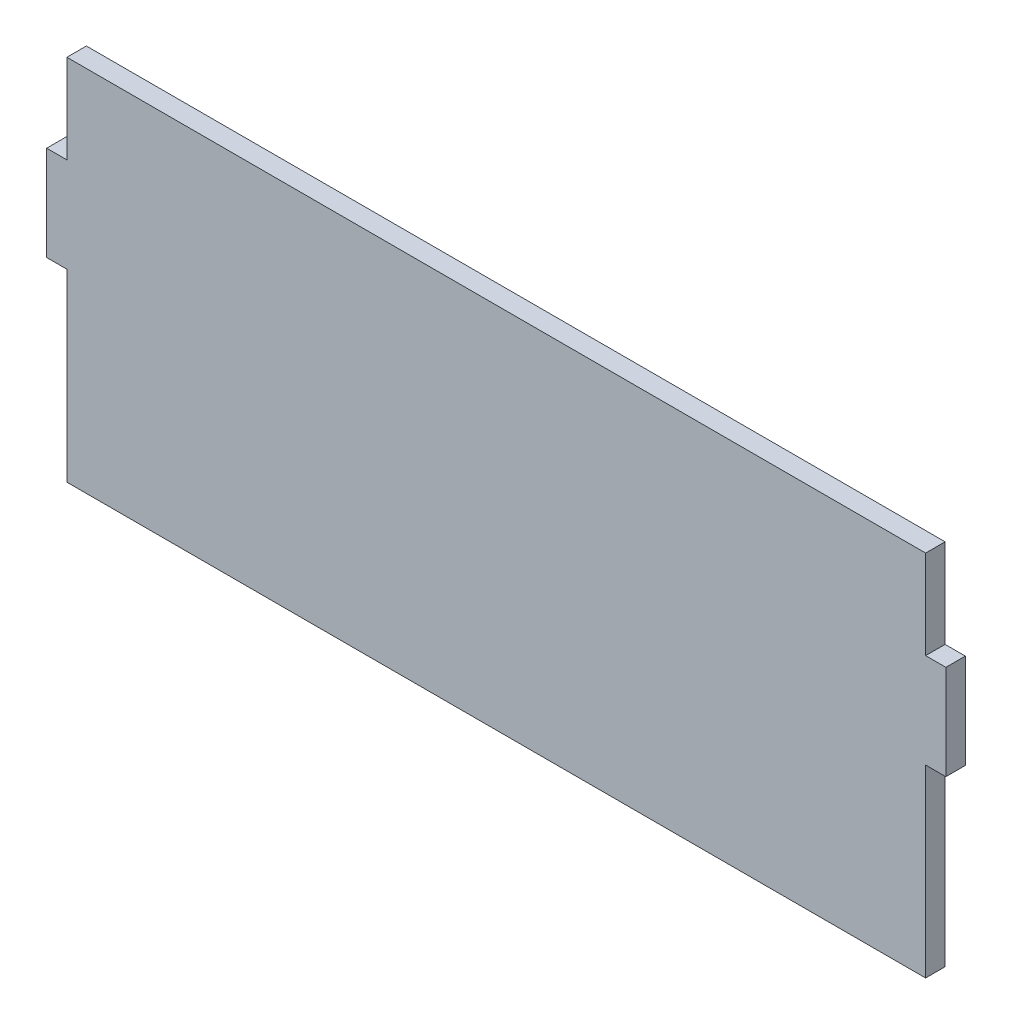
ISO-10303-21;
HEADER;
FILE_DESCRIPTION(('STEP AP214'),'2;1');
FILE_NAME('part.step','',(''),(''),'','','');
FILE_SCHEMA(('AUTOMOTIVE_DESIGN { 1 0 10303 214 1 1 1 1 }'));
ENDSEC;
DATA;
#1=APPLICATION_CONTEXT('core data for automotive mechanical design processes');
#2=APPLICATION_PROTOCOL_DEFINITION('international standard','automotive_design',2000,#1);
#3=PRODUCT_CONTEXT('',#1,'mechanical');
#4=PRODUCT('Part','Part','',(#3));
#5=PRODUCT_RELATED_PRODUCT_CATEGORY('part','',(#4));
#6=PRODUCT_DEFINITION_FORMATION('','',#4);
#7=PRODUCT_DEFINITION_CONTEXT('part definition',#1,'design');
#8=PRODUCT_DEFINITION('design','',#6,#7);
#9=PRODUCT_DEFINITION_SHAPE('','',#8);
#10=(LENGTH_UNIT() NAMED_UNIT(*) SI_UNIT(.MILLI.,.METRE.));
#11=(NAMED_UNIT(*) PLANE_ANGLE_UNIT() SI_UNIT($,.RADIAN.));
#12=(NAMED_UNIT(*) SI_UNIT($,.STERADIAN.) SOLID_ANGLE_UNIT());
#13=UNCERTAINTY_MEASURE_WITH_UNIT(LENGTH_MEASURE(1.E-05),#10,'distance_accuracy_value','');
#14=(GEOMETRIC_REPRESENTATION_CONTEXT(3) GLOBAL_UNCERTAINTY_ASSIGNED_CONTEXT((#13)) GLOBAL_UNIT_ASSIGNED_CONTEXT((#10,
#11,#12)) REPRESENTATION_CONTEXT('',''));
#15=CARTESIAN_POINT('',(0.,0.,0.));
#16=DIRECTION('',(0.,0.,1.));
#17=DIRECTION('',(1.,0.,0.));
#18=AXIS2_PLACEMENT_3D('',#15,#16,#17);
#19=CARTESIAN_POINT('',(-70.0367249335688,20.7668110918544,2.6));
#20=DIRECTION('',(0.,-1.,0.));
#21=DIRECTION('',(1.,0.,0.));
#22=AXIS2_PLACEMENT_3D('',#19,#20,#21);
#23=PLANE('',#22);
#24=DIRECTION('',(-1.,0.,0.));
#25=VECTOR('',#24,1.);
#26=CARTESIAN_POINT('',(-70.0367249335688,20.7668110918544,0.));
#27=LINE('',#26,#25);
#28=CARTESIAN_POINT('',(44.5632750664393,20.7668110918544,0.));
#29=VERTEX_POINT('',#28);
#30=CARTESIAN_POINT('',(-70.0367249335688,20.7668110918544,0.));
#31=VERTEX_POINT('',#30);
#32=EDGE_CURVE('E102',#29,#31,#27,.T.);
#33=ORIENTED_EDGE('',*,*,#32,.T.);
#34=DIRECTION('',(0.,0.,-1.));
#35=VECTOR('',#34,1.);
#36=CARTESIAN_POINT('',(-70.0367249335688,20.7668110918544,2.6));
#37=LINE('',#36,#35);
#38=CARTESIAN_POINT('',(-70.0367249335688,20.7668110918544,2.6));
#39=VERTEX_POINT('',#38);
#40=EDGE_CURVE('E11',#39,#31,#37,.T.);
#41=ORIENTED_EDGE('',*,*,#40,.F.);
#42=DIRECTION('',(-1.,0.,0.));
#43=VECTOR('',#42,1.);
#44=CARTESIAN_POINT('',(44.5632750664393,20.7668110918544,2.6));
#45=LINE('',#44,#43);
#46=CARTESIAN_POINT('',(44.5632750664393,20.7668110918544,2.6));
#47=VERTEX_POINT('',#46);
#48=EDGE_CURVE('E108',#47,#39,#45,.T.);
#49=ORIENTED_EDGE('',*,*,#48,.F.);
#50=DIRECTION('',(0.,0.,-1.));
#51=VECTOR('',#50,1.);
#52=CARTESIAN_POINT('',(44.5632750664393,20.7668110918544,2.6));
#53=LINE('',#52,#51);
#54=EDGE_CURVE('E153',#47,#29,#53,.T.);
#55=ORIENTED_EDGE('',*,*,#54,.T.);
#56=EDGE_LOOP('',(#33,#41,#49,#55));
#57=FACE_BOUND('',#56,.T.);
#58=ADVANCED_FACE('F38',(#57),#23,.F.);
#59=CARTESIAN_POINT('',(-70.0367249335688,8.9074360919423,2.6));
#60=DIRECTION('',(1.,0.,0.));
#61=DIRECTION('',(0.,0.,-1.));
#62=AXIS2_PLACEMENT_3D('',#59,#60,#61);
#63=PLANE('',#62);
#64=DIRECTION('',(0.,-1.,0.));
#65=VECTOR('',#64,1.);
#66=CARTESIAN_POINT('',(-70.0367249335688,8.9074360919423,0.));
#67=LINE('',#66,#65);
#68=CARTESIAN_POINT('',(-70.0367249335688,8.9074360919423,0.));
#69=VERTEX_POINT('',#68);
#70=EDGE_CURVE('E158',#31,#69,#67,.T.);
#71=ORIENTED_EDGE('',*,*,#70,.T.);
#72=DIRECTION('',(0.,0.,-1.));
#73=VECTOR('',#72,1.);
#74=CARTESIAN_POINT('',(-70.0367249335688,8.9074360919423,2.6));
#75=LINE('',#74,#73);
#76=CARTESIAN_POINT('',(-70.0367249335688,8.9074360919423,2.6));
#77=VERTEX_POINT('',#76);
#78=EDGE_CURVE('E46',#77,#69,#75,.T.);
#79=ORIENTED_EDGE('',*,*,#78,.F.);
#80=DIRECTION('',(0.,-1.,0.));
#81=VECTOR('',#80,1.);
#82=CARTESIAN_POINT('',(-70.0367249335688,8.9074360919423,2.6));
#83=LINE('',#82,#81);
#84=EDGE_CURVE('E248',#39,#77,#83,.T.);
#85=ORIENTED_EDGE('',*,*,#84,.F.);
#86=ORIENTED_EDGE('',*,*,#40,.T.);
#87=EDGE_LOOP('',(#71,#79,#85,#86));
#88=FACE_BOUND('',#87,.T.);
#89=ADVANCED_FACE('F251',(#88),#63,.F.);
#90=CARTESIAN_POINT('',(-72.7367249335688,8.9074360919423,2.6));
#91=DIRECTION('',(0.,-1.,0.));
#92=DIRECTION('',(1.,0.,0.));
#93=AXIS2_PLACEMENT_3D('',#90,#91,#92);
#94=PLANE('',#93);
#95=DIRECTION('',(-1.,0.,0.));
#96=VECTOR('',#95,1.);
#97=CARTESIAN_POINT('',(-72.7367249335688,8.9074360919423,0.));
#98=LINE('',#97,#96);
#99=CARTESIAN_POINT('',(-72.7367249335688,8.9074360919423,0.));
#100=VERTEX_POINT('',#99);
#101=EDGE_CURVE('E160',#69,#100,#98,.T.);
#102=ORIENTED_EDGE('',*,*,#101,.T.);
#103=DIRECTION('',(0.,0.,-1.));
#104=VECTOR('',#103,1.);
#105=CARTESIAN_POINT('',(-72.7367249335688,8.9074360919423,2.6));
#106=LINE('',#105,#104);
#107=CARTESIAN_POINT('',(-72.7367249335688,8.9074360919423,2.6));
#108=VERTEX_POINT('',#107);
#109=EDGE_CURVE('E199',#108,#100,#106,.T.);
#110=ORIENTED_EDGE('',*,*,#109,.F.);
#111=DIRECTION('',(-1.,0.,0.));
#112=VECTOR('',#111,1.);
#113=CARTESIAN_POINT('',(-72.7367249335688,8.9074360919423,2.6));
#114=LINE('',#113,#112);
#115=EDGE_CURVE('E208',#77,#108,#114,.T.);
#116=ORIENTED_EDGE('',*,*,#115,.F.);
#117=ORIENTED_EDGE('',*,*,#78,.T.);
#118=EDGE_LOOP('',(#102,#110,#116,#117));
#119=FACE_BOUND('',#118,.T.);
#120=ADVANCED_FACE('F206',(#119),#94,.F.);
#121=CARTESIAN_POINT('',(-72.7367249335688,-3.73314796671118,2.6));
#122=DIRECTION('',(1.,0.,0.));
#123=DIRECTION('',(0.,1.,0.));
#124=AXIS2_PLACEMENT_3D('',#121,#122,#123);
#125=PLANE('',#124);
#126=DIRECTION('',(0.,-1.,0.));
#127=VECTOR('',#126,1.);
#128=CARTESIAN_POINT('',(-72.7367249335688,-3.73314796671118,0.));
#129=LINE('',#128,#127);
#130=CARTESIAN_POINT('',(-72.7367249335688,-3.73314796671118,0.));
#131=VERTEX_POINT('',#130);
#132=EDGE_CURVE('E163',#100,#131,#129,.T.);
#133=ORIENTED_EDGE('',*,*,#132,.T.);
#134=DIRECTION('',(0.,0.,-1.));
#135=VECTOR('',#134,1.);
#136=CARTESIAN_POINT('',(-72.7367249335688,-3.73314796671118,2.6));
#137=LINE('',#136,#135);
#138=CARTESIAN_POINT('',(-72.7367249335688,-3.73314796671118,2.6));
#139=VERTEX_POINT('',#138);
#140=EDGE_CURVE('E196',#139,#131,#137,.T.);
#141=ORIENTED_EDGE('',*,*,#140,.F.);
#142=DIRECTION('',(0.,-1.,0.));
#143=VECTOR('',#142,1.);
#144=CARTESIAN_POINT('',(-72.7367249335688,8.9074360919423,2.6));
#145=LINE('',#144,#143);
#146=EDGE_CURVE('E225',#108,#139,#145,.T.);
#147=ORIENTED_EDGE('',*,*,#146,.F.);
#148=ORIENTED_EDGE('',*,*,#109,.T.);
#149=EDGE_LOOP('',(#133,#141,#147,#148));
#150=FACE_BOUND('',#149,.T.);
#151=ADVANCED_FACE('F216',(#150),#125,.F.);
#152=CARTESIAN_POINT('',(-72.7367249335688,-3.73314796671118,2.6));
#153=DIRECTION('',(0.,1.,0.));
#154=DIRECTION('',(0.,0.,1.));
#155=AXIS2_PLACEMENT_3D('',#152,#153,#154);
#156=PLANE('',#155);
#157=DIRECTION('',(1.,0.,0.));
#158=VECTOR('',#157,1.);
#159=CARTESIAN_POINT('',(-72.7367249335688,-3.73314796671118,0.));
#160=LINE('',#159,#158);
#161=CARTESIAN_POINT('',(-70.036724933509,-3.73314796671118,0.));
#162=VERTEX_POINT('',#161);
#163=EDGE_CURVE('E165',#131,#162,#160,.T.);
#164=ORIENTED_EDGE('',*,*,#163,.T.);
#165=DIRECTION('',(0.,0.,-1.));
#166=VECTOR('',#165,1.);
#167=CARTESIAN_POINT('',(-70.036724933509,-3.73314796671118,2.6));
#168=LINE('',#167,#166);
#169=CARTESIAN_POINT('',(-70.036724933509,-3.73314796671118,2.6));
#170=VERTEX_POINT('',#169);
#171=EDGE_CURVE('E193',#170,#162,#168,.T.);
#172=ORIENTED_EDGE('',*,*,#171,.F.);
#173=DIRECTION('',(1.,0.,0.));
#174=VECTOR('',#173,1.);
#175=CARTESIAN_POINT('',(-72.7367249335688,-3.73314796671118,2.6));
#176=LINE('',#175,#174);
#177=EDGE_CURVE('E222',#139,#170,#176,.T.);
#178=ORIENTED_EDGE('',*,*,#177,.F.);
#179=ORIENTED_EDGE('',*,*,#140,.T.);
#180=EDGE_LOOP('',(#164,#172,#178,#179));
#181=FACE_BOUND('',#180,.T.);
#182=ADVANCED_FACE('F220',(#181),#156,.F.);
#183=CARTESIAN_POINT('',(-70.036724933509,-3.73314796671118,2.6));
#184=DIRECTION('',(1.,0.,0.));
#185=DIRECTION('',(0.,0.,-1.));
#186=AXIS2_PLACEMENT_3D('',#183,#184,#185);
#187=PLANE('',#186);
#188=DIRECTION('',(0.,-1.,0.));
#189=VECTOR('',#188,1.);
#190=CARTESIAN_POINT('',(-70.036724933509,-3.73314796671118,0.));
#191=LINE('',#190,#189);
#192=CARTESIAN_POINT('',(-70.036724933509,-28.3482029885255,0.));
#193=VERTEX_POINT('',#192);
#194=EDGE_CURVE('E167',#162,#193,#191,.T.);
#195=ORIENTED_EDGE('',*,*,#194,.T.);
#196=DIRECTION('',(0.,0.,-1.));
#197=VECTOR('',#196,1.);
#198=CARTESIAN_POINT('',(-70.036724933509,-28.3482029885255,2.6));
#199=LINE('',#198,#197);
#200=CARTESIAN_POINT('',(-70.036724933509,-28.3482029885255,2.6));
#201=VERTEX_POINT('',#200);
#202=EDGE_CURVE('E190',#201,#193,#199,.T.);
#203=ORIENTED_EDGE('',*,*,#202,.F.);
#204=DIRECTION('',(0.,-1.,0.));
#205=VECTOR('',#204,1.);
#206=CARTESIAN_POINT('',(-70.036724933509,-3.73314796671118,2.6));
#207=LINE('',#206,#205);
#208=EDGE_CURVE('E224',#170,#201,#207,.T.);
#209=ORIENTED_EDGE('',*,*,#208,.F.);
#210=ORIENTED_EDGE('',*,*,#171,.T.);
#211=EDGE_LOOP('',(#195,#203,#209,#210));
#212=FACE_BOUND('',#211,.T.);
#213=ADVANCED_FACE('F263',(#212),#187,.F.);
#214=CARTESIAN_POINT('',(-70.036724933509,-28.3482029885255,2.6));
#215=DIRECTION('',(0.,1.,0.));
#216=DIRECTION('',(0.,0.,1.));
#217=AXIS2_PLACEMENT_3D('',#214,#215,#216);
#218=PLANE('',#217);
#219=DIRECTION('',(1.,0.,0.));
#220=VECTOR('',#219,1.);
#221=CARTESIAN_POINT('',(-70.036724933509,-28.3482029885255,0.));
#222=LINE('',#221,#220);
#223=CARTESIAN_POINT('',(44.563275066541,-28.3482029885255,0.));
#224=VERTEX_POINT('',#223);
#225=EDGE_CURVE('E169',#193,#224,#222,.T.);
#226=ORIENTED_EDGE('',*,*,#225,.T.);
#227=DIRECTION('',(0.,0.,-1.));
#228=VECTOR('',#227,1.);
#229=CARTESIAN_POINT('',(44.563275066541,-28.3482029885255,2.6));
#230=LINE('',#229,#228);
#231=CARTESIAN_POINT('',(44.563275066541,-28.3482029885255,2.6));
#232=VERTEX_POINT('',#231);
#233=EDGE_CURVE('E187',#232,#224,#230,.T.);
#234=ORIENTED_EDGE('',*,*,#233,.F.);
#235=DIRECTION('',(1.,0.,0.));
#236=VECTOR('',#235,1.);
#237=CARTESIAN_POINT('',(-70.036724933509,-28.3482029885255,2.6));
#238=LINE('',#237,#236);
#239=EDGE_CURVE('E227',#201,#232,#238,.T.);
#240=ORIENTED_EDGE('',*,*,#239,.F.);
#241=ORIENTED_EDGE('',*,*,#202,.T.);
#242=EDGE_LOOP('',(#226,#234,#240,#241));
#243=FACE_BOUND('',#242,.T.);
#244=ADVANCED_FACE('F266',(#243),#218,.F.);
#245=CARTESIAN_POINT('',(44.563275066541,-3.73314796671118,2.6));
#246=DIRECTION('',(-1.,0.,0.));
#247=DIRECTION('',(0.,0.,1.));
#248=AXIS2_PLACEMENT_3D('',#245,#246,#247);
#249=PLANE('',#248);
#250=DIRECTION('',(0.,1.,0.));
#251=VECTOR('',#250,1.);
#252=CARTESIAN_POINT('',(44.563275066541,-3.73314796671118,0.));
#253=LINE('',#252,#251);
#254=CARTESIAN_POINT('',(44.563275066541,-3.73314796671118,0.));
#255=VERTEX_POINT('',#254);
#256=EDGE_CURVE('E171',#224,#255,#253,.T.);
#257=ORIENTED_EDGE('',*,*,#256,.T.);
#258=DIRECTION('',(0.,0.,-1.));
#259=VECTOR('',#258,1.);
#260=CARTESIAN_POINT('',(44.563275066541,-3.73314796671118,2.6));
#261=LINE('',#260,#259);
#262=CARTESIAN_POINT('',(44.563275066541,-3.73314796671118,2.6));
#263=VERTEX_POINT('',#262);
#264=EDGE_CURVE('E184',#263,#255,#261,.T.);
#265=ORIENTED_EDGE('',*,*,#264,.F.);
#266=DIRECTION('',(0.,1.,0.));
#267=VECTOR('',#266,1.);
#268=CARTESIAN_POINT('',(44.563275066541,-3.73314796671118,2.6));
#269=LINE('',#268,#267);
#270=EDGE_CURVE('E233',#232,#263,#269,.T.);
#271=ORIENTED_EDGE('',*,*,#270,.F.);
#272=ORIENTED_EDGE('',*,*,#233,.T.);
#273=EDGE_LOOP('',(#257,#265,#271,#272));
#274=FACE_BOUND('',#273,.T.);
#275=ADVANCED_FACE('F239',(#274),#249,.F.);
#276=CARTESIAN_POINT('',(44.563275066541,-3.73314796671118,2.6));
#277=DIRECTION('',(0.,1.,0.));
#278=DIRECTION('',(0.,0.,1.));
#279=AXIS2_PLACEMENT_3D('',#276,#277,#278);
#280=PLANE('',#279);
#281=DIRECTION('',(1.,0.,0.));
#282=VECTOR('',#281,1.);
#283=CARTESIAN_POINT('',(44.563275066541,-3.73314796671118,0.));
#284=LINE('',#283,#282);
#285=CARTESIAN_POINT('',(47.2632750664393,-3.73314796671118,0.));
#286=VERTEX_POINT('',#285);
#287=EDGE_CURVE('E173',#255,#286,#284,.T.);
#288=ORIENTED_EDGE('',*,*,#287,.T.);
#289=DIRECTION('',(0.,0.,-1.));
#290=VECTOR('',#289,1.);
#291=CARTESIAN_POINT('',(47.2632750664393,-3.73314796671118,2.6));
#292=LINE('',#291,#290);
#293=CARTESIAN_POINT('',(47.2632750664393,-3.73314796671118,2.6));
#294=VERTEX_POINT('',#293);
#295=EDGE_CURVE('E148',#294,#286,#292,.T.);
#296=ORIENTED_EDGE('',*,*,#295,.F.);
#297=DIRECTION('',(1.,0.,0.));
#298=VECTOR('',#297,1.);
#299=CARTESIAN_POINT('',(44.563275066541,-3.73314796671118,2.6));
#300=LINE('',#299,#298);
#301=EDGE_CURVE('E140',#263,#294,#300,.T.);
#302=ORIENTED_EDGE('',*,*,#301,.F.);
#303=ORIENTED_EDGE('',*,*,#264,.T.);
#304=EDGE_LOOP('',(#288,#296,#302,#303));
#305=FACE_BOUND('',#304,.T.);
#306=ADVANCED_FACE('F243',(#305),#280,.F.);
#307=CARTESIAN_POINT('',(47.2632750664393,-2.23318890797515,2.6));
#308=DIRECTION('',(-1.,0.,0.));
#309=DIRECTION('',(0.,0.,1.));
#310=AXIS2_PLACEMENT_3D('',#307,#308,#309);
#311=PLANE('',#310);
#312=DIRECTION('',(0.,1.,0.));
#313=VECTOR('',#312,1.);
#314=CARTESIAN_POINT('',(47.2632750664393,-2.23318890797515,0.));
#315=LINE('',#314,#313);
#316=CARTESIAN_POINT('',(47.2632750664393,8.90743609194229,0.));
#317=VERTEX_POINT('',#316);
#318=EDGE_CURVE('E147',#286,#317,#315,.T.);
#319=ORIENTED_EDGE('',*,*,#318,.T.);
#320=DIRECTION('',(0.,0.,-1.));
#321=VECTOR('',#320,1.);
#322=CARTESIAN_POINT('',(47.2632750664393,8.90743609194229,2.6));
#323=LINE('',#322,#321);
#324=CARTESIAN_POINT('',(47.2632750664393,8.90743609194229,2.6));
#325=VERTEX_POINT('',#324);
#326=EDGE_CURVE('E145',#325,#317,#323,.T.);
#327=ORIENTED_EDGE('',*,*,#326,.F.);
#328=DIRECTION('',(0.,1.,0.));
#329=VECTOR('',#328,1.);
#330=CARTESIAN_POINT('',(47.2632750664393,-3.73314796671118,2.6));
#331=LINE('',#330,#329);
#332=EDGE_CURVE('E134',#294,#325,#331,.T.);
#333=ORIENTED_EDGE('',*,*,#332,.F.);
#334=ORIENTED_EDGE('',*,*,#295,.T.);
#335=EDGE_LOOP('',(#319,#327,#333,#334));
#336=FACE_BOUND('',#335,.T.);
#337=ADVANCED_FACE('F146',(#336),#311,.F.);
#338=CARTESIAN_POINT('',(44.5632750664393,8.90743609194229,2.6));
#339=DIRECTION('',(0.,-1.,0.));
#340=DIRECTION('',(0.,0.,-1.));
#341=AXIS2_PLACEMENT_3D('',#338,#339,#340);
#342=PLANE('',#341);
#343=DIRECTION('',(-1.,0.,0.));
#344=VECTOR('',#343,1.);
#345=CARTESIAN_POINT('',(44.5632750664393,8.90743609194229,0.));
#346=LINE('',#345,#344);
#347=CARTESIAN_POINT('',(44.5632750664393,8.90743609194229,0.));
#348=VERTEX_POINT('',#347);
#349=EDGE_CURVE('E95',#317,#348,#346,.T.);
#350=ORIENTED_EDGE('',*,*,#349,.T.);
#351=DIRECTION('',(0.,0.,-1.));
#352=VECTOR('',#351,1.);
#353=CARTESIAN_POINT('',(44.5632750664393,8.90743609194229,2.6));
#354=LINE('',#353,#352);
#355=CARTESIAN_POINT('',(44.5632750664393,8.90743609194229,2.6));
#356=VERTEX_POINT('',#355);
#357=EDGE_CURVE('E149',#356,#348,#354,.T.);
#358=ORIENTED_EDGE('',*,*,#357,.F.);
#359=DIRECTION('',(-1.,0.,0.));
#360=VECTOR('',#359,1.);
#361=CARTESIAN_POINT('',(44.5632750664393,8.90743609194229,2.6));
#362=LINE('',#361,#360);
#363=EDGE_CURVE('E138',#325,#356,#362,.T.);
#364=ORIENTED_EDGE('',*,*,#363,.F.);
#365=ORIENTED_EDGE('',*,*,#326,.T.);
#366=EDGE_LOOP('',(#350,#358,#364,#365));
#367=FACE_BOUND('',#366,.T.);
#368=ADVANCED_FACE('F151',(#367),#342,.F.);
#369=CARTESIAN_POINT('',(44.5632750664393,20.7668110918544,2.6));
#370=DIRECTION('',(-1.,0.,0.));
#371=DIRECTION('',(0.,0.,1.));
#372=AXIS2_PLACEMENT_3D('',#369,#370,#371);
#373=PLANE('',#372);
#374=DIRECTION('',(0.,1.,0.));
#375=VECTOR('',#374,1.);
#376=CARTESIAN_POINT('',(44.5632750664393,20.7668110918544,0.));
#377=LINE('',#376,#375);
#378=EDGE_CURVE('E178',#348,#29,#377,.T.);
#379=ORIENTED_EDGE('',*,*,#378,.T.);
#380=ORIENTED_EDGE('',*,*,#54,.F.);
#381=DIRECTION('',(0.,1.,0.));
#382=VECTOR('',#381,1.);
#383=CARTESIAN_POINT('',(44.5632750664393,20.7668110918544,2.6));
#384=LINE('',#383,#382);
#385=EDGE_CURVE('E54',#356,#47,#384,.T.);
#386=ORIENTED_EDGE('',*,*,#385,.F.);
#387=ORIENTED_EDGE('',*,*,#357,.T.);
#388=EDGE_LOOP('',(#379,#380,#386,#387));
#389=FACE_BOUND('',#388,.T.);
#390=ADVANCED_FACE('F246',(#389),#373,.F.);
#391=CARTESIAN_POINT('',(0.,0.,2.6));
#392=DIRECTION('',(0.,0.,-1.));
#393=DIRECTION('',(-1.,0.,0.));
#394=AXIS2_PLACEMENT_3D('',#391,#392,#393);
#395=PLANE('',#394);
#396=ORIENTED_EDGE('',*,*,#48,.T.);
#397=ORIENTED_EDGE('',*,*,#84,.T.);
#398=ORIENTED_EDGE('',*,*,#115,.T.);
#399=ORIENTED_EDGE('',*,*,#146,.T.);
#400=ORIENTED_EDGE('',*,*,#177,.T.);
#401=ORIENTED_EDGE('',*,*,#208,.T.);
#402=ORIENTED_EDGE('',*,*,#239,.T.);
#403=ORIENTED_EDGE('',*,*,#270,.T.);
#404=ORIENTED_EDGE('',*,*,#301,.T.);
#405=ORIENTED_EDGE('',*,*,#332,.T.);
#406=ORIENTED_EDGE('',*,*,#363,.T.);
#407=ORIENTED_EDGE('',*,*,#385,.T.);
#408=EDGE_LOOP('',(#396,#397,#398,#399,#400,#401,#402,#403,#404,#405,#406,#407));
#409=FACE_BOUND('',#408,.T.);
#410=ADVANCED_FACE('F136',(#409),#395,.F.);
#411=CARTESIAN_POINT('',(0.,0.,0.));
#412=DIRECTION('',(0.,0.,-1.));
#413=DIRECTION('',(-1.,0.,0.));
#414=AXIS2_PLACEMENT_3D('',#411,#412,#413);
#415=PLANE('',#414);
#416=ORIENTED_EDGE('',*,*,#32,.F.);
#417=ORIENTED_EDGE('',*,*,#378,.F.);
#418=ORIENTED_EDGE('',*,*,#349,.F.);
#419=ORIENTED_EDGE('',*,*,#318,.F.);
#420=ORIENTED_EDGE('',*,*,#287,.F.);
#421=ORIENTED_EDGE('',*,*,#256,.F.);
#422=ORIENTED_EDGE('',*,*,#225,.F.);
#423=ORIENTED_EDGE('',*,*,#194,.F.);
#424=ORIENTED_EDGE('',*,*,#163,.F.);
#425=ORIENTED_EDGE('',*,*,#132,.F.);
#426=ORIENTED_EDGE('',*,*,#101,.F.);
#427=ORIENTED_EDGE('',*,*,#70,.F.);
#428=EDGE_LOOP('',(#416,#417,#418,#419,#420,#421,#422,#423,#424,#425,#426,#427));
#429=FACE_BOUND('',#428,.T.);
#430=ADVANCED_FACE('F211',(#429),#415,.T.);
#431=CLOSED_SHELL('',(#58,#89,#120,#151,#182,#213,#244,#275,#306,#337,#368,#390,#410,#430));
#432=MANIFOLD_SOLID_BREP('B2',#431);
#433=ADVANCED_BREP_SHAPE_REPRESENTATION('',(#18,#432),#14);
#434=SHAPE_DEFINITION_REPRESENTATION(#9,#433);
ENDSEC;
END-ISO-10303-21;
